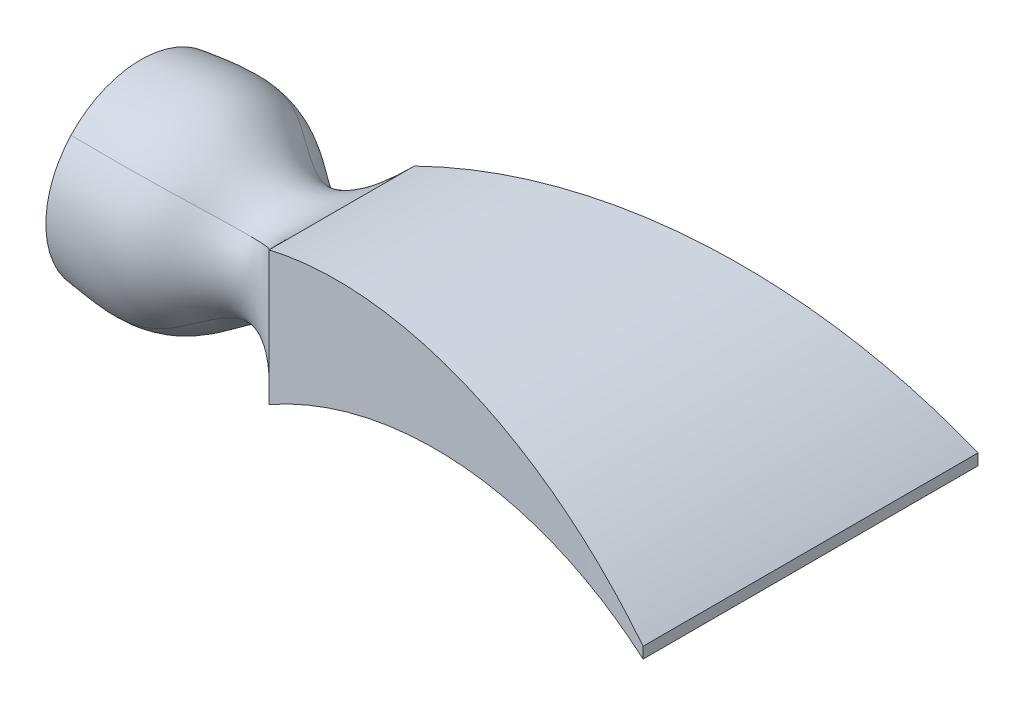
ISO-10303-21;
HEADER;
FILE_DESCRIPTION(('STEP AP214'),'2;1');
FILE_NAME('part.step','',(''),(''),'','','');
FILE_SCHEMA(('AUTOMOTIVE_DESIGN { 1 0 10303 214 1 1 1 1 }'));
ENDSEC;
DATA;
#1=APPLICATION_CONTEXT('core data for automotive mechanical design processes');
#2=APPLICATION_PROTOCOL_DEFINITION('international standard','automotive_design',2000,#1);
#3=PRODUCT_CONTEXT('',#1,'mechanical');
#4=PRODUCT('Part','Part','',(#3));
#5=PRODUCT_RELATED_PRODUCT_CATEGORY('part','',(#4));
#6=PRODUCT_DEFINITION_FORMATION('','',#4);
#7=PRODUCT_DEFINITION_CONTEXT('part definition',#1,'design');
#8=PRODUCT_DEFINITION('design','',#6,#7);
#9=PRODUCT_DEFINITION_SHAPE('','',#8);
#10=(LENGTH_UNIT() NAMED_UNIT(*) SI_UNIT(.MILLI.,.METRE.));
#11=(NAMED_UNIT(*) PLANE_ANGLE_UNIT() SI_UNIT($,.RADIAN.));
#12=(NAMED_UNIT(*) SI_UNIT($,.STERADIAN.) SOLID_ANGLE_UNIT());
#13=UNCERTAINTY_MEASURE_WITH_UNIT(LENGTH_MEASURE(1.E-05),#10,'distance_accuracy_value','');
#14=(GEOMETRIC_REPRESENTATION_CONTEXT(3) GLOBAL_UNCERTAINTY_ASSIGNED_CONTEXT((#13)) GLOBAL_UNIT_ASSIGNED_CONTEXT((#10,
#11,#12)) REPRESENTATION_CONTEXT('',''));
#15=CARTESIAN_POINT('',(0.,0.,0.));
#16=DIRECTION('',(0.,0.,1.));
#17=DIRECTION('',(1.,0.,0.));
#18=AXIS2_PLACEMENT_3D('',#15,#16,#17);
#19=CARTESIAN_POINT('',(0.,0.,0.));
#20=DIRECTION('',(1.,0.,0.));
#21=DIRECTION('',(0.,0.,-1.));
#22=AXIS2_PLACEMENT_3D('',#19,#20,#21);
#23=PLANE('',#22);
#24=CARTESIAN_POINT('',(0.,0.,0.));
#25=DIRECTION('',(1.,0.,0.));
#26=DIRECTION('',(0.,0.,-1.));
#27=AXIS2_PLACEMENT_3D('',#24,#25,#26);
#28=CIRCLE('',#27,42.5);
#29=CARTESIAN_POINT('',(0.,-28.8269043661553,-31.2291463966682));
#30=VERTEX_POINT('',#29);
#31=CARTESIAN_POINT('',(0.,28.8269043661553,-31.2291463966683));
#32=VERTEX_POINT('',#31);
#33=EDGE_CURVE('E353',#30,#32,#28,.T.);
#34=ORIENTED_EDGE('',*,*,#33,.F.);
#35=CARTESIAN_POINT('',(0.,-28.8269043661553,31.2291463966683));
#36=VERTEX_POINT('',#35);
#37=EDGE_CURVE('E358',#36,#30,#28,.T.);
#38=ORIENTED_EDGE('',*,*,#37,.F.);
#39=CARTESIAN_POINT('',(0.,28.8269043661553,31.2291463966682));
#40=VERTEX_POINT('',#39);
#41=EDGE_CURVE('E365',#40,#36,#28,.T.);
#42=ORIENTED_EDGE('',*,*,#41,.F.);
#43=EDGE_CURVE('E361',#32,#40,#28,.T.);
#44=ORIENTED_EDGE('',*,*,#43,.F.);
#45=EDGE_LOOP('',(#34,#38,#42,#44));
#46=FACE_BOUND('',#45,.T.);
#47=ADVANCED_FACE('F204',(#46),#23,.F.);
#48=CARTESIAN_POINT('',(0.,28.8269043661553,31.2291463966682));
#49=CARTESIAN_POINT('',(14.0252873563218,30.0049287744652,32.5053395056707));
#50=CARTESIAN_POINT('',(38.049638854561,32.7541160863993,35.483625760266));
#51=CARTESIAN_POINT('',(64.2575115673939,11.0839417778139,12.0076035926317));
#52=CARTESIAN_POINT('',(82.1458189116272,21.8102928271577,23.6278172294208));
#53=CARTESIAN_POINT('',(90.,30.,32.5));
#54=CARTESIAN_POINT('',(0.,12.5555966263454,46.2488150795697));
#55=CARTESIAN_POINT('',(14.0252873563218,12.9482714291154,47.5250081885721));
#56=CARTESIAN_POINT('',(38.049638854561,13.8832946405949,50.5982429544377));
#57=CARTESIAN_POINT('',(64.2575115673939,5.86382028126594,23.064396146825));
#58=CARTESIAN_POINT('',(82.1458189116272,7.27009760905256,23.6278172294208));
#59=CARTESIAN_POINT('',(90.,10.,32.5));
#60=CARTESIAN_POINT('',(0.,-12.5555966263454,46.2488150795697));
#61=CARTESIAN_POINT('',(14.0252873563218,-12.9482714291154,47.5250081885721));
#62=CARTESIAN_POINT('',(38.049638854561,-13.8832946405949,50.5982429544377));
#63=CARTESIAN_POINT('',(64.2575115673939,-5.86382028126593,23.064396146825));
#64=CARTESIAN_POINT('',(82.1458189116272,-7.27009760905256,23.6278172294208));
#65=CARTESIAN_POINT('',(90.,-10.,32.5));
#66=CARTESIAN_POINT('',(0.,-28.8269043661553,31.2291463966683));
#67=CARTESIAN_POINT('',(14.0252873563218,-30.0049287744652,32.5053395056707));
#68=CARTESIAN_POINT('',(38.049638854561,-32.7541160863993,35.4836257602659));
#69=CARTESIAN_POINT('',(64.2575115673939,-11.0839417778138,12.0076035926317));
#70=CARTESIAN_POINT('',(82.1458189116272,-21.8102928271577,23.6278172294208));
#71=CARTESIAN_POINT('',(90.,-30.,32.5));
#72=B_SPLINE_SURFACE_WITH_KNOTS('',3,3,((#48,#49,#50,#51,#52,#53),(#54,#55,#56,#57,#58,#59),
(#60,#61,#62,#63,#64,#65),(#66,#67,#68,#69,#70,#71)),.UNSPECIFIED.,.F.,.F.,.F.,(4,4),(4,1,1,4),
(0.,1.),(0.,0.409369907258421,0.7071658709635,1.),.UNSPECIFIED.);
#73=CARTESIAN_POINT('',(0.,-28.8269043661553,31.2291463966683));
#74=CARTESIAN_POINT('',(14.0252873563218,-30.0049287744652,32.5053395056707));
#75=CARTESIAN_POINT('',(38.049638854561,-32.7541160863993,35.4836257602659));
#76=CARTESIAN_POINT('',(64.2575115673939,-11.0839417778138,12.0076035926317));
#77=CARTESIAN_POINT('',(82.1458189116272,-21.8102928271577,23.6278172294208));
#78=CARTESIAN_POINT('',(90.,-30.,32.5));
#79=B_SPLINE_CURVE_WITH_KNOTS('',3,(#73,#74,#75,#76,#77,#78),.UNSPECIFIED.,.F.,.F.,(4,1,1,4),
(0.,0.409369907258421,0.7071658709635,1.),.UNSPECIFIED.);
#80=CARTESIAN_POINT('',(90.,-30.,32.5));
#81=VERTEX_POINT('',#80);
#82=EDGE_CURVE('E233',#36,#81,#79,.T.);
#83=DIRECTION('',(0.,-1.,0.));
#84=VECTOR('',#83,1.);
#85=CARTESIAN_POINT('',(90.,-30.,32.5));
#86=LINE('',#85,#84);
#87=CARTESIAN_POINT('',(90.,30.,32.5));
#88=VERTEX_POINT('',#87);
#89=EDGE_CURVE('E217',#88,#81,#86,.T.);
#90=CARTESIAN_POINT('',(0.,28.8269043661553,31.2291463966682));
#91=CARTESIAN_POINT('',(14.0252873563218,30.0049287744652,32.5053395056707));
#92=CARTESIAN_POINT('',(38.049638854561,32.7541160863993,35.483625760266));
#93=CARTESIAN_POINT('',(64.2575115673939,11.0839417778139,12.0076035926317));
#94=CARTESIAN_POINT('',(82.1458189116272,21.8102928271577,23.6278172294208));
#95=CARTESIAN_POINT('',(90.,30.,32.5));
#96=B_SPLINE_CURVE_WITH_KNOTS('',3,(#90,#91,#92,#93,#94,#95),.UNSPECIFIED.,.F.,.F.,(4,1,1,4),
(0.,0.409369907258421,0.7071658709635,1.),.UNSPECIFIED.);
#97=EDGE_CURVE('E446',#88,#40,#96,.F.);
#98=ORIENTED_EDGE('',*,*,#41,.T.);
#99=ORIENTED_EDGE('',*,*,#82,.T.);
#100=ORIENTED_EDGE('',*,*,#89,.F.);
#101=ORIENTED_EDGE('',*,*,#97,.T.);
#102=EDGE_LOOP('',(#98,#99,#100,#101));
#103=FACE_BOUND('',#102,.T.);
#104=ADVANCED_FACE('F386',(#103),#72,.T.);
#105=CARTESIAN_POINT('',(0.,-28.8269043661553,31.2291463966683));
#106=CARTESIAN_POINT('',(14.0252873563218,-30.0049287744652,32.5053395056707));
#107=CARTESIAN_POINT('',(38.049638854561,-32.7541160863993,35.483625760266));
#108=CARTESIAN_POINT('',(64.2575115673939,-11.0839417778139,12.0076035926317));
#109=CARTESIAN_POINT('',(82.1458189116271,-21.8102928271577,23.6278172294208));
#110=CARTESIAN_POINT('',(90.,-30.,32.5));
#111=CARTESIAN_POINT('',(0.,-31.0057855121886,29.2178714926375));
#112=CARTESIAN_POINT('',(14.0252560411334,-32.2675112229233,30.4072340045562));
#113=CARTESIAN_POINT('',(38.0079865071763,-35.0074364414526,33.134204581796));
#114=CARTESIAN_POINT('',(64.3604771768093,-12.475367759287,11.3962638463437));
#115=CARTESIAN_POINT('',(81.9263489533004,-22.2778386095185,21.7600120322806));
#116=CARTESIAN_POINT('',(90.,-30.,29.7916666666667));
#117=CARTESIAN_POINT('',(0.,-33.9206748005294,25.8954245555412));
#118=CARTESIAN_POINT('',(14.0252090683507,-35.3079524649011,26.9545411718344));
#119=CARTESIAN_POINT('',(37.9455079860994,-38.0312564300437,29.3019499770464));
#120=CARTESIAN_POINT('',(64.5149255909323,-14.3035464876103,10.2559568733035));
#121=CARTESIAN_POINT('',(81.5971440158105,-22.9791572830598,18.9583042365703));
#122=CARTESIAN_POINT('',(90.,-30.,25.7291666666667));
#123=CARTESIAN_POINT('',(0.,-37.0494048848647,20.9740485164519));
#124=CARTESIAN_POINT('',(14.025322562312,-38.5632606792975,21.8310323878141));
#125=CARTESIAN_POINT('',(37.8988243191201,-41.2834499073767,23.6831781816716));
#126=CARTESIAN_POINT('',(64.6302175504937,-16.255801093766,8.43102119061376));
#127=CARTESIAN_POINT('',(81.3514262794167,-23.7455118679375,15.0861877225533));
#128=CARTESIAN_POINT('',(90.0000000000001,-30.,20.3125));
#129=CARTESIAN_POINT('',(0.,-38.9996836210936,17.0769647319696));
#130=CARTESIAN_POINT('',(14.0253779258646,-40.5934404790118,17.7754496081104));
#131=CARTESIAN_POINT('',(37.872711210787,-43.3120934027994,19.2572261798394));
#132=CARTESIAN_POINT('',(64.6947136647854,-17.4685107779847,6.92696460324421));
#133=CARTESIAN_POINT('',(81.2139665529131,-24.2360568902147,12.1394883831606));
#134=CARTESIAN_POINT('',(90.0000000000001,-30.,16.25));
#135=CARTESIAN_POINT('',(0.,-40.5422247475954,12.9939174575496));
#136=CARTESIAN_POINT('',(14.0251611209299,-42.1990179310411,13.5241865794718));
#137=CARTESIAN_POINT('',(37.8553861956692,-44.9176257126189,14.6330297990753));
#138=CARTESIAN_POINT('',(64.7376940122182,-18.4253077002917,5.32072772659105));
#139=CARTESIAN_POINT('',(81.1223192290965,-24.6275231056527,9.15397849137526));
#140=CARTESIAN_POINT('',(90.0000000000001,-30.,12.1875));
#141=CARTESIAN_POINT('',(0.,-42.0351974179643,7.37053527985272));
#142=CARTESIAN_POINT('',(14.0253533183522,-43.7529740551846,7.67182588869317));
#143=CARTESIAN_POINT('',(37.8405440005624,-46.4719777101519,8.28857635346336));
#144=CARTESIAN_POINT('',(64.7742321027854,-19.3503599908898,3.04664159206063));
#145=CARTESIAN_POINT('',(81.0444738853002,-25.0090345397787,5.12143933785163));
#146=CARTESIAN_POINT('',(90.,-30.,6.77083333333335));
#147=CARTESIAN_POINT('',(0.,-42.8106082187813,-0.000175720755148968));
#148=CARTESIAN_POINT('',(14.0253047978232,-44.5601581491,-0.00020295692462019));
#149=CARTESIAN_POINT('',(37.8345893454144,-47.2796606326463,-0.000240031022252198));
#150=CARTESIAN_POINT('',(64.7889851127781,-19.8297609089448,4.72186189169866E-05));
#151=CARTESIAN_POINT('',(81.0130204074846,-25.2075581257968,2.55297718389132E-05));
#152=CARTESIAN_POINT('',(89.9999999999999,-30.,0.));
#153=CARTESIAN_POINT('',(0.,-42.0352320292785,-7.37019257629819));
#154=CARTESIAN_POINT('',(14.0253511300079,-43.7530146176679,-7.67143011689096));
#155=CARTESIAN_POINT('',(37.8405452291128,-46.4720247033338,-8.28810822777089));
#156=CARTESIAN_POINT('',(64.7742307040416,-19.3503509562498,-3.04673364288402));
#157=CARTESIAN_POINT('',(81.0444764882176,-25.0090290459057,-5.12148921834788));
#158=CARTESIAN_POINT('',(90.,-30.,-6.77083333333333));
#159=CARTESIAN_POINT('',(0.,-40.5422308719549,-12.9939763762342));
#160=CARTESIAN_POINT('',(14.0251623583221,-42.1990246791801,-13.5242545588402));
#161=CARTESIAN_POINT('',(37.855385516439,-44.9176342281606,-14.633110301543));
#162=CARTESIAN_POINT('',(64.7376947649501,-18.42530592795,-5.32071189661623));
#163=CARTESIAN_POINT('',(81.1223178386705,-24.6275224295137,-9.15396991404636));
#164=CARTESIAN_POINT('',(90.,-30.,-12.1875));
#165=CARTESIAN_POINT('',(0.,-38.9996771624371,-17.0769448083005));
#166=CARTESIAN_POINT('',(14.0253771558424,-40.5934332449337,-17.7754266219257));
#167=CARTESIAN_POINT('',(37.8727116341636,-43.3120844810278,-19.2571989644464));
#168=CARTESIAN_POINT('',(64.6947131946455,-17.4685125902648,-6.92696993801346));
#169=CARTESIAN_POINT('',(81.213967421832,-24.2360577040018,-12.1394913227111));
#170=CARTESIAN_POINT('',(90.0000000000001,-30.,-16.25));
#171=CARTESIAN_POINT('',(0.,-37.0494129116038,-20.9740493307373));
#172=CARTESIAN_POINT('',(14.0253228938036,-38.5632697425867,-21.8310334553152));
#173=CARTESIAN_POINT('',(37.8988241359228,-41.283460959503,-23.683179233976));
#174=CARTESIAN_POINT('',(64.6302177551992,-16.2557988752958,-8.43102102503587));
#175=CARTESIAN_POINT('',(81.3514259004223,-23.7455107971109,-15.0861875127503));
#176=CARTESIAN_POINT('',(90.0000000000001,-30.,-20.3125));
#177=CARTESIAN_POINT('',(0.,-33.9206215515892,-25.8954921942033));
#178=CARTESIAN_POINT('',(14.0252088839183,-35.3078916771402,-26.9546184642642));
#179=CARTESIAN_POINT('',(37.945508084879,-38.0311834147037,-29.3020426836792));
#180=CARTESIAN_POINT('',(64.5149254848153,-14.3035609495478,-10.2559385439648));
#181=CARTESIAN_POINT('',(81.5971442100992,-22.9791648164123,-18.9582945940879));
#182=CARTESIAN_POINT('',(90.,-30.,-25.7291666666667));
#183=CARTESIAN_POINT('',(0.,-31.0057855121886,-29.2178714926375));
#184=CARTESIAN_POINT('',(14.0252559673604,-32.267508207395,-30.4072378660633));
#185=CARTESIAN_POINT('',(38.0079865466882,-35.0074380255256,-33.134202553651));
#186=CARTESIAN_POINT('',(64.3604771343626,-12.4753661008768,-11.3962659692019));
#187=CARTESIAN_POINT('',(81.9263490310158,-22.2778416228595,-21.7600081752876));
#188=CARTESIAN_POINT('',(90.,-30.,-29.7916666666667));
#189=CARTESIAN_POINT('',(0.,-28.8269043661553,-31.2291463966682));
#190=CARTESIAN_POINT('',(14.0252873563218,-30.0049287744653,-32.5053395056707));
#191=CARTESIAN_POINT('',(38.049638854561,-32.7541160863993,-35.4836257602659));
#192=CARTESIAN_POINT('',(64.2575115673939,-11.0839417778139,-12.0076035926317));
#193=CARTESIAN_POINT('',(82.1458189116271,-21.8102928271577,-23.6278172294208));
#194=CARTESIAN_POINT('',(90.,-30.,-32.5));
#195=B_SPLINE_SURFACE_WITH_KNOTS('',3,3,((#105,#106,#107,#108,#109,#110),(#111,#112,#113,#114,
#115,#116),(#117,#118,#119,#120,#121,#122),(#123,#124,#125,#126,#127,#128),(#129,#130,#131,#132,
#133,#134),(#135,#136,#137,#138,#139,#140),(#141,#142,#143,#144,#145,#146),(#147,#148,#149,#150,
#151,#152),(#153,#154,#155,#156,#157,#158),(#159,#160,#161,#162,#163,#164),(#165,#166,#167,#168,
#169,#170),(#171,#172,#173,#174,#175,#176),(#177,#178,#179,#180,#181,#182),(#183,#184,#185,#186,
#187,#188),(#189,#190,#191,#192,#193,#194)),.UNSPECIFIED.,.F.,.F.,.F.,(4,1,1,1,1,1,1,1,1,1,1,1,
4),(4,1,1,4),(0.,0.125,0.1875,0.25,0.3125,0.375,0.5,0.625,0.6875,0.75,0.8125,0.875,1.),(0.,
0.409369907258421,0.7071658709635,1.),.UNSPECIFIED.);
#196=CARTESIAN_POINT('',(0.,-28.8269043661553,-31.2291463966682));
#197=CARTESIAN_POINT('',(14.0252873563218,-30.0049287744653,-32.5053395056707));
#198=CARTESIAN_POINT('',(38.049638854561,-32.7541160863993,-35.4836257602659));
#199=CARTESIAN_POINT('',(64.2575115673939,-11.0839417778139,-12.0076035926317));
#200=CARTESIAN_POINT('',(82.1458189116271,-21.8102928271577,-23.6278172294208));
#201=CARTESIAN_POINT('',(90.,-30.,-32.5));
#202=B_SPLINE_CURVE_WITH_KNOTS('',3,(#196,#197,#198,#199,#200,#201),.UNSPECIFIED.,.F.,.F.,(4,1,
1,4),(0.,0.409369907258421,0.7071658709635,1.),.UNSPECIFIED.);
#203=CARTESIAN_POINT('',(90.,-30.,-32.5));
#204=VERTEX_POINT('',#203);
#205=EDGE_CURVE('E427',#30,#204,#202,.T.);
#206=DIRECTION('',(0.,0.,-1.));
#207=VECTOR('',#206,1.);
#208=CARTESIAN_POINT('',(90.,-30.,32.5));
#209=LINE('',#208,#207);
#210=EDGE_CURVE('E13',#81,#204,#209,.T.);
#211=ORIENTED_EDGE('',*,*,#37,.T.);
#212=ORIENTED_EDGE('',*,*,#205,.T.);
#213=ORIENTED_EDGE('',*,*,#210,.F.);
#214=ORIENTED_EDGE('',*,*,#82,.F.);
#215=EDGE_LOOP('',(#211,#212,#213,#214));
#216=FACE_BOUND('',#215,.T.);
#217=ADVANCED_FACE('F481',(#216),#195,.T.);
#218=CARTESIAN_POINT('',(0.,28.8269043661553,-31.2291463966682));
#219=CARTESIAN_POINT('',(14.0252873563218,30.0049287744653,-32.5053395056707));
#220=CARTESIAN_POINT('',(38.049638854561,32.7541160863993,-35.483625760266));
#221=CARTESIAN_POINT('',(64.2575115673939,11.0839417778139,-12.0076035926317));
#222=CARTESIAN_POINT('',(82.1458189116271,21.8102928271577,-23.6278172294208));
#223=CARTESIAN_POINT('',(90.,30.,-32.5));
#224=CARTESIAN_POINT('',(0.,31.0057855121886,-29.2178714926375));
#225=CARTESIAN_POINT('',(14.0252560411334,32.2675112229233,-30.4072340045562));
#226=CARTESIAN_POINT('',(38.0079865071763,35.0074364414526,-33.134204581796));
#227=CARTESIAN_POINT('',(64.3604771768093,12.475367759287,-11.3962638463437));
#228=CARTESIAN_POINT('',(81.9263489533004,22.2778386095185,-21.7600120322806));
#229=CARTESIAN_POINT('',(90.,30.,-29.7916666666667));
#230=CARTESIAN_POINT('',(0.,33.9206748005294,-25.8954245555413));
#231=CARTESIAN_POINT('',(14.0252090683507,35.307952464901,-26.9545411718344));
#232=CARTESIAN_POINT('',(37.9455079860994,38.0312564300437,-29.3019499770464));
#233=CARTESIAN_POINT('',(64.5149255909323,14.3035464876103,-10.2559568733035));
#234=CARTESIAN_POINT('',(81.5971440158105,22.9791572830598,-18.9583042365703));
#235=CARTESIAN_POINT('',(90.,30.,-25.7291666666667));
#236=CARTESIAN_POINT('',(0.,37.0494048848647,-20.9740485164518));
#237=CARTESIAN_POINT('',(14.025322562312,38.5632606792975,-21.831032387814));
#238=CARTESIAN_POINT('',(37.8988243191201,41.2834499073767,-23.6831781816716));
#239=CARTESIAN_POINT('',(64.6302175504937,16.255801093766,-8.43102119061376));
#240=CARTESIAN_POINT('',(81.3514262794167,23.7455118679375,-15.0861877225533));
#241=CARTESIAN_POINT('',(90.0000000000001,30.,-20.3125));
#242=CARTESIAN_POINT('',(0.,38.9996836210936,-17.0769647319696));
#243=CARTESIAN_POINT('',(14.0253779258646,40.5934404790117,-17.7754496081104));
#244=CARTESIAN_POINT('',(37.872711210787,43.3120934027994,-19.2572261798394));
#245=CARTESIAN_POINT('',(64.6947136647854,17.4685107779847,-6.9269646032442));
#246=CARTESIAN_POINT('',(81.2139665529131,24.2360568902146,-12.1394883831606));
#247=CARTESIAN_POINT('',(90.0000000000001,30.,-16.25));
#248=CARTESIAN_POINT('',(0.,40.5422247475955,-12.9939174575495));
#249=CARTESIAN_POINT('',(14.0251611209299,42.1990179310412,-13.5241865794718));
#250=CARTESIAN_POINT('',(37.8553861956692,44.9176257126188,-14.6330297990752));
#251=CARTESIAN_POINT('',(64.7376940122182,18.4253077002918,-5.32072772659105));
#252=CARTESIAN_POINT('',(81.1223192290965,24.6275231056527,-9.15397849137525));
#253=CARTESIAN_POINT('',(90.0000000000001,30.,-12.1875));
#254=CARTESIAN_POINT('',(0.,42.0351974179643,-7.37053527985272));
#255=CARTESIAN_POINT('',(14.0253533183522,43.7529740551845,-7.67182588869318));
#256=CARTESIAN_POINT('',(37.8405440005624,46.471977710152,-8.28857635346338));
#257=CARTESIAN_POINT('',(64.7742321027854,19.3503599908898,-3.04664159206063));
#258=CARTESIAN_POINT('',(81.0444738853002,25.0090345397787,-5.12143933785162));
#259=CARTESIAN_POINT('',(90.,30.,-6.77083333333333));
#260=CARTESIAN_POINT('',(0.,42.8106082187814,0.000175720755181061));
#261=CARTESIAN_POINT('',(14.0253047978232,44.5601581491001,0.000202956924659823));
#262=CARTESIAN_POINT('',(37.8345893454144,47.2796606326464,0.000240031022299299));
#263=CARTESIAN_POINT('',(64.7889851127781,19.8297609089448,-4.72186189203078E-05));
#264=CARTESIAN_POINT('',(81.0130204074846,25.2075581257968,-2.55297718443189E-05));
#265=CARTESIAN_POINT('',(89.9999999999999,30.,0.));
#266=CARTESIAN_POINT('',(0.,42.0352320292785,7.37019257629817));
#267=CARTESIAN_POINT('',(14.0253511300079,43.753014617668,7.67143011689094));
#268=CARTESIAN_POINT('',(37.8405452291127,46.4720247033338,8.28810822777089));
#269=CARTESIAN_POINT('',(64.7742307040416,19.3503509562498,3.04673364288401));
#270=CARTESIAN_POINT('',(81.0444764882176,25.0090290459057,5.12148921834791));
#271=CARTESIAN_POINT('',(90.,30.,6.77083333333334));
#272=CARTESIAN_POINT('',(0.,40.542230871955,12.9939763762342));
#273=CARTESIAN_POINT('',(14.0251623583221,42.19902467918,13.5242545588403));
#274=CARTESIAN_POINT('',(37.855385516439,44.9176342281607,14.633110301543));
#275=CARTESIAN_POINT('',(64.7376947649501,18.42530592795,5.32071189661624));
#276=CARTESIAN_POINT('',(81.1223178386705,24.6275224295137,9.15396991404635));
#277=CARTESIAN_POINT('',(90.,30.,12.1875));
#278=CARTESIAN_POINT('',(0.,38.999677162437,17.0769448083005));
#279=CARTESIAN_POINT('',(14.0253771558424,40.5934332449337,17.7754266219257));
#280=CARTESIAN_POINT('',(37.8727116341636,43.3120844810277,19.2571989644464));
#281=CARTESIAN_POINT('',(64.6947131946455,17.4685125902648,6.92696993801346));
#282=CARTESIAN_POINT('',(81.213967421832,24.2360577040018,12.1394913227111));
#283=CARTESIAN_POINT('',(90.0000000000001,30.,16.25));
#284=CARTESIAN_POINT('',(0.,37.0494129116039,20.9740493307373));
#285=CARTESIAN_POINT('',(14.0253228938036,38.5632697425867,21.8310334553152));
#286=CARTESIAN_POINT('',(37.8988241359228,41.2834609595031,23.6831792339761));
#287=CARTESIAN_POINT('',(64.6302177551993,16.2557988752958,8.43102102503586));
#288=CARTESIAN_POINT('',(81.3514259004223,23.7455107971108,15.0861875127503));
#289=CARTESIAN_POINT('',(90.0000000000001,30.,20.3125));
#290=CARTESIAN_POINT('',(0.,33.9206215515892,25.8954921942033));
#291=CARTESIAN_POINT('',(14.0252088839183,35.3078916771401,26.9546184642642));
#292=CARTESIAN_POINT('',(37.9455080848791,38.0311834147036,29.3020426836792));
#293=CARTESIAN_POINT('',(64.5149254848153,14.3035609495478,10.2559385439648));
#294=CARTESIAN_POINT('',(81.5971442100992,22.9791648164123,18.9582945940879));
#295=CARTESIAN_POINT('',(90.,30.,25.7291666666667));
#296=CARTESIAN_POINT('',(0.,31.0057855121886,29.2178714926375));
#297=CARTESIAN_POINT('',(14.0252559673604,32.267508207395,30.4072378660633));
#298=CARTESIAN_POINT('',(38.0079865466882,35.0074380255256,33.1342025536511));
#299=CARTESIAN_POINT('',(64.3604771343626,12.4753661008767,11.3962659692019));
#300=CARTESIAN_POINT('',(81.9263490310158,22.2778416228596,21.7600081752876));
#301=CARTESIAN_POINT('',(90.,30.,29.7916666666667));
#302=CARTESIAN_POINT('',(0.,28.8269043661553,31.2291463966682));
#303=CARTESIAN_POINT('',(14.0252873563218,30.0049287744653,32.5053395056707));
#304=CARTESIAN_POINT('',(38.049638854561,32.7541160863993,35.483625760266));
#305=CARTESIAN_POINT('',(64.2575115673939,11.0839417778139,12.0076035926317));
#306=CARTESIAN_POINT('',(82.1458189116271,21.8102928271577,23.6278172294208));
#307=CARTESIAN_POINT('',(90.,30.,32.5));
#308=B_SPLINE_SURFACE_WITH_KNOTS('',3,3,((#218,#219,#220,#221,#222,#223),(#224,#225,#226,#227,
#228,#229),(#230,#231,#232,#233,#234,#235),(#236,#237,#238,#239,#240,#241),(#242,#243,#244,#245,
#246,#247),(#248,#249,#250,#251,#252,#253),(#254,#255,#256,#257,#258,#259),(#260,#261,#262,#263,
#264,#265),(#266,#267,#268,#269,#270,#271),(#272,#273,#274,#275,#276,#277),(#278,#279,#280,#281,
#282,#283),(#284,#285,#286,#287,#288,#289),(#290,#291,#292,#293,#294,#295),(#296,#297,#298,#299,
#300,#301),(#302,#303,#304,#305,#306,#307)),.UNSPECIFIED.,.F.,.F.,.F.,(4,1,1,1,1,1,1,1,1,1,1,1,
4),(4,1,1,4),(0.,0.125,0.1875,0.25,0.3125,0.375,0.5,0.625,0.6875,0.75,0.8125,0.875,1.),(0.,
0.409369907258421,0.7071658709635,1.),.UNSPECIFIED.);
#309=DIRECTION('',(0.,0.,1.));
#310=VECTOR('',#309,1.);
#311=CARTESIAN_POINT('',(90.,30.,32.5));
#312=LINE('',#311,#310);
#313=CARTESIAN_POINT('',(90.,30.,-32.5));
#314=VERTEX_POINT('',#313);
#315=EDGE_CURVE('E405',#314,#88,#312,.T.);
#316=CARTESIAN_POINT('',(0.,28.8269043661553,-31.2291463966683));
#317=CARTESIAN_POINT('',(14.0252873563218,30.0049287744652,-32.5053395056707));
#318=CARTESIAN_POINT('',(38.049638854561,32.7541160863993,-35.483625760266));
#319=CARTESIAN_POINT('',(64.2575115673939,11.0839417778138,-12.0076035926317));
#320=CARTESIAN_POINT('',(82.1458189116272,21.8102928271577,-23.6278172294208));
#321=CARTESIAN_POINT('',(90.,30.,-32.5));
#322=B_SPLINE_CURVE_WITH_KNOTS('',3,(#316,#317,#318,#319,#320,#321),.UNSPECIFIED.,.F.,.F.,(4,1,
1,4),(0.,0.409369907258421,0.7071658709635,1.),.UNSPECIFIED.);
#323=EDGE_CURVE('E422',#32,#314,#322,.T.);
#324=ORIENTED_EDGE('',*,*,#43,.T.);
#325=ORIENTED_EDGE('',*,*,#97,.F.);
#326=ORIENTED_EDGE('',*,*,#315,.F.);
#327=ORIENTED_EDGE('',*,*,#323,.F.);
#328=EDGE_LOOP('',(#324,#325,#326,#327));
#329=FACE_BOUND('',#328,.T.);
#330=ADVANCED_FACE('F471',(#329),#308,.T.);
#331=CARTESIAN_POINT('',(0.,-28.8269043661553,-31.2291463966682));
#332=CARTESIAN_POINT('',(14.0252873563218,-30.0049287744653,-32.5053395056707));
#333=CARTESIAN_POINT('',(38.049638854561,-32.7541160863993,-35.483625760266));
#334=CARTESIAN_POINT('',(64.2575115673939,-11.0839417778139,-12.0076035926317));
#335=CARTESIAN_POINT('',(82.1458189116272,-21.8102928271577,-23.6278172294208));
#336=CARTESIAN_POINT('',(90.,-30.,-32.5));
#337=CARTESIAN_POINT('',(0.,-12.5555966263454,-46.2488150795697));
#338=CARTESIAN_POINT('',(14.0252873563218,-12.9482714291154,-47.5250081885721));
#339=CARTESIAN_POINT('',(38.049638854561,-13.8832946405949,-50.5982429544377));
#340=CARTESIAN_POINT('',(64.2575115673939,-5.86382028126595,-23.064396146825));
#341=CARTESIAN_POINT('',(82.1458189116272,-7.27009760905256,-23.6278172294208));
#342=CARTESIAN_POINT('',(90.,-10.,-32.5));
#343=CARTESIAN_POINT('',(0.,12.5555966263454,-46.2488150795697));
#344=CARTESIAN_POINT('',(14.0252873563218,12.9482714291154,-47.5250081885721));
#345=CARTESIAN_POINT('',(38.049638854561,13.8832946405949,-50.5982429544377));
#346=CARTESIAN_POINT('',(64.2575115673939,5.86382028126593,-23.064396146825));
#347=CARTESIAN_POINT('',(82.1458189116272,7.27009760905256,-23.6278172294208));
#348=CARTESIAN_POINT('',(90.,10.,-32.5));
#349=CARTESIAN_POINT('',(0.,28.8269043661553,-31.2291463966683));
#350=CARTESIAN_POINT('',(14.0252873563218,30.0049287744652,-32.5053395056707));
#351=CARTESIAN_POINT('',(38.049638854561,32.7541160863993,-35.483625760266));
#352=CARTESIAN_POINT('',(64.2575115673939,11.0839417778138,-12.0076035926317));
#353=CARTESIAN_POINT('',(82.1458189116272,21.8102928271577,-23.6278172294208));
#354=CARTESIAN_POINT('',(90.,30.,-32.5));
#355=B_SPLINE_SURFACE_WITH_KNOTS('',3,3,((#331,#332,#333,#334,#335,#336),(#337,#338,#339,#340,
#341,#342),(#343,#344,#345,#346,#347,#348),(#349,#350,#351,#352,#353,#354)),.UNSPECIFIED.,.F.,
.F.,.F.,(4,4),(4,1,1,4),(0.,1.),(0.,0.409369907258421,0.7071658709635,1.),.UNSPECIFIED.);
#356=DIRECTION('',(0.,1.,0.));
#357=VECTOR('',#356,1.);
#358=CARTESIAN_POINT('',(90.,-30.,-32.5));
#359=LINE('',#358,#357);
#360=EDGE_CURVE('E225',#204,#314,#359,.T.);
#361=ORIENTED_EDGE('',*,*,#33,.T.);
#362=ORIENTED_EDGE('',*,*,#323,.T.);
#363=ORIENTED_EDGE('',*,*,#360,.F.);
#364=ORIENTED_EDGE('',*,*,#205,.F.);
#365=EDGE_LOOP('',(#361,#362,#363,#364));
#366=FACE_BOUND('',#365,.T.);
#367=ADVANCED_FACE('F206',(#366),#355,.T.);
#368=CARTESIAN_POINT('',(300.,0.,0.));
#369=DIRECTION('',(-1.,0.,0.));
#370=DIRECTION('',(0.,0.,1.));
#371=AXIS2_PLACEMENT_3D('',#368,#369,#370);
#372=PLANE('',#371);
#373=DIRECTION('',(0.,1.,0.));
#374=VECTOR('',#373,1.);
#375=CARTESIAN_POINT('',(300.,-2.5,-75.));
#376=LINE('',#375,#374);
#377=CARTESIAN_POINT('',(300.,-2.5,-75.));
#378=VERTEX_POINT('',#377);
#379=CARTESIAN_POINT('',(300.,2.5,-75.));
#380=VERTEX_POINT('',#379);
#381=EDGE_CURVE('E336',#378,#380,#376,.T.);
#382=ORIENTED_EDGE('',*,*,#381,.T.);
#383=DIRECTION('',(0.,0.,1.));
#384=VECTOR('',#383,1.);
#385=CARTESIAN_POINT('',(300.,2.5,75.));
#386=LINE('',#385,#384);
#387=CARTESIAN_POINT('',(300.,2.5,75.));
#388=VERTEX_POINT('',#387);
#389=EDGE_CURVE('E292',#380,#388,#386,.T.);
#390=ORIENTED_EDGE('',*,*,#389,.T.);
#391=DIRECTION('',(0.,-1.,0.));
#392=VECTOR('',#391,1.);
#393=CARTESIAN_POINT('',(300.,-2.5,75.));
#394=LINE('',#393,#392);
#395=CARTESIAN_POINT('',(300.,-2.5,75.));
#396=VERTEX_POINT('',#395);
#397=EDGE_CURVE('E269',#388,#396,#394,.T.);
#398=ORIENTED_EDGE('',*,*,#397,.T.);
#399=DIRECTION('',(0.,0.,-1.));
#400=VECTOR('',#399,1.);
#401=CARTESIAN_POINT('',(300.,-2.5,75.));
#402=LINE('',#401,#400);
#403=EDGE_CURVE('E275',#396,#378,#402,.T.);
#404=ORIENTED_EDGE('',*,*,#403,.T.);
#405=EDGE_LOOP('',(#382,#390,#398,#404));
#406=FACE_BOUND('',#405,.T.);
#407=ADVANCED_FACE('F291',(#406),#372,.F.);
#408=CARTESIAN_POINT('',(90.,30.,-32.5));
#409=CARTESIAN_POINT('',(160.089094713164,57.3447577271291,-46.6666666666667));
#410=CARTESIAN_POINT('',(239.315206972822,46.9699096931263,-60.8333333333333));
#411=CARTESIAN_POINT('',(300.,2.5,-75.));
#412=CARTESIAN_POINT('',(90.,30.,-27.9351780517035));
#413=CARTESIAN_POINT('',(160.089094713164,57.3447577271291,-42.3074673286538));
#414=CARTESIAN_POINT('',(239.315206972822,46.9699096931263,-56.6797566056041));
#415=CARTESIAN_POINT('',(300.,2.5,-71.0520458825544));
#416=CARTESIAN_POINT('',(90.,30.,-22.350652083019));
#417=CARTESIAN_POINT('',(160.089094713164,57.3447577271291,-35.6376420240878));
#418=CARTESIAN_POINT('',(239.315206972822,46.9699096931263,-48.9246319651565));
#419=CARTESIAN_POINT('',(300.,2.5,-62.2116219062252));
#420=CARTESIAN_POINT('',(90.0000000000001,30.,-14.6017532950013));
#421=CARTESIAN_POINT('',(160.089094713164,57.3447577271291,-24.6636818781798));
#422=CARTESIAN_POINT('',(239.315206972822,46.9699096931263,-34.7256104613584));
#423=CARTESIAN_POINT('',(300.,2.5,-44.787539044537));
#424=CARTESIAN_POINT('',(90.,30.,-7.67503183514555));
#425=CARTESIAN_POINT('',(160.089094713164,57.3447577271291,-12.1148643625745));
#426=CARTESIAN_POINT('',(239.315206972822,46.9699096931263,-16.5546968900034));
#427=CARTESIAN_POINT('',(300.,2.5,-20.9945294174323));
#428=CARTESIAN_POINT('',(90.,30.,-2.70833333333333));
#429=CARTESIAN_POINT('',(160.089094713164,57.3447577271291,-3.88888888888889));
#430=CARTESIAN_POINT('',(239.315206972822,46.9699096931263,-5.06944444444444));
#431=CARTESIAN_POINT('',(300.,2.5,-6.25));
#432=CARTESIAN_POINT('',(90.,30.,2.70833333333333));
#433=CARTESIAN_POINT('',(160.089094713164,57.3447577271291,3.88888888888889));
#434=CARTESIAN_POINT('',(239.315206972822,46.9699096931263,5.06944444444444));
#435=CARTESIAN_POINT('',(300.,2.5,6.25));
#436=CARTESIAN_POINT('',(90.,30.,7.67503183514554));
#437=CARTESIAN_POINT('',(160.089094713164,57.3447577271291,12.1148643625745));
#438=CARTESIAN_POINT('',(239.315206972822,46.9699096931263,16.5546968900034));
#439=CARTESIAN_POINT('',(300.,2.5,20.9945294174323));
#440=CARTESIAN_POINT('',(90.0000000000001,30.,14.6017532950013));
#441=CARTESIAN_POINT('',(160.089094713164,57.3447577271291,24.6636818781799));
#442=CARTESIAN_POINT('',(239.315206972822,46.9699096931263,34.7256104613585));
#443=CARTESIAN_POINT('',(300.,2.5,44.787539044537));
#444=CARTESIAN_POINT('',(89.9999999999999,30.,22.3506520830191));
#445=CARTESIAN_POINT('',(160.089094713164,57.3447577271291,35.6376420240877));
#446=CARTESIAN_POINT('',(239.315206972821,46.9699096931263,48.9246319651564));
#447=CARTESIAN_POINT('',(300.,2.5,62.2116219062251));
#448=CARTESIAN_POINT('',(90.,30.,27.9351780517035));
#449=CARTESIAN_POINT('',(160.089094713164,57.3447577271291,42.3074673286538));
#450=CARTESIAN_POINT('',(239.315206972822,46.9699096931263,56.679756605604));
#451=CARTESIAN_POINT('',(300.,2.5,71.0520458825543));
#452=CARTESIAN_POINT('',(90.,30.,32.5));
#453=CARTESIAN_POINT('',(160.089094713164,57.3447577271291,46.6666666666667));
#454=CARTESIAN_POINT('',(239.315206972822,46.9699096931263,60.8333333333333));
#455=CARTESIAN_POINT('',(300.,2.5,75.));
#456=B_SPLINE_SURFACE_WITH_KNOTS('',3,3,((#408,#409,#410,#411),(#412,#413,#414,#415),(#416,#417,
#418,#419),(#420,#421,#422,#423),(#424,#425,#426,#427),(#428,#429,#430,#431),(#432,#433,#434,
#435),(#436,#437,#438,#439),(#440,#441,#442,#443),(#444,#445,#446,#447),(#448,#449,#450,#451),
(#452,#453,#454,#455)),.UNSPECIFIED.,.F.,.F.,.F.,(4,1,1,1,2,1,1,1,4),(4,4),(0.628064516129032,
0.674556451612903,0.721048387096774,0.767540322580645,0.814032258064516,0.860524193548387,
0.907016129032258,0.953508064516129,1.),(0.,1.),.UNSPECIFIED.);
#457=CARTESIAN_POINT('',(90.,30.,32.5));
#458=CARTESIAN_POINT('',(160.089094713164,57.3447577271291,46.6666666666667));
#459=CARTESIAN_POINT('',(239.315206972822,46.9699096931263,60.8333333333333));
#460=CARTESIAN_POINT('',(300.,2.5,75.));
#461=B_SPLINE_CURVE_WITH_KNOTS('',3,(#457,#458,#459,#460),.UNSPECIFIED.,.F.,.F.,(4,4),(0.,1.),.UNSPECIFIED.);
#462=EDGE_CURVE('E509',#88,#388,#461,.T.);
#463=CARTESIAN_POINT('',(90.,30.,-32.5));
#464=CARTESIAN_POINT('',(160.089094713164,57.3447577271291,-46.6666666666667));
#465=CARTESIAN_POINT('',(239.315206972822,46.9699096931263,-60.8333333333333));
#466=CARTESIAN_POINT('',(300.,2.5,-75.));
#467=B_SPLINE_CURVE_WITH_KNOTS('',3,(#463,#464,#465,#466),.UNSPECIFIED.,.F.,.F.,(4,4),(0.,1.),.UNSPECIFIED.);
#468=EDGE_CURVE('E581',#314,#380,#467,.T.);
#469=ORIENTED_EDGE('',*,*,#315,.T.);
#470=ORIENTED_EDGE('',*,*,#462,.T.);
#471=ORIENTED_EDGE('',*,*,#389,.F.);
#472=ORIENTED_EDGE('',*,*,#468,.F.);
#473=EDGE_LOOP('',(#469,#470,#471,#472));
#474=FACE_BOUND('',#473,.T.);
#475=ADVANCED_FACE('F312',(#474),#456,.T.);
#476=CARTESIAN_POINT('',(90.,-30.,-32.5));
#477=CARTESIAN_POINT('',(160.089094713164,15.6780910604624,-46.6666666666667));
#478=CARTESIAN_POINT('',(239.315206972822,23.636576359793,-60.8333333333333));
#479=CARTESIAN_POINT('',(300.,-2.5,-75.));
#480=CARTESIAN_POINT('',(90.,-25.,-32.5));
#481=CARTESIAN_POINT('',(160.089094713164,19.1503132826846,-46.6666666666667));
#482=CARTESIAN_POINT('',(239.315206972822,25.5810208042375,-60.8333333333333));
#483=CARTESIAN_POINT('',(300.,-2.08333333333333,-75.));
#484=CARTESIAN_POINT('',(89.9999999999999,-15.,-32.5));
#485=CARTESIAN_POINT('',(160.089094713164,26.0947577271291,-46.6666666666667));
#486=CARTESIAN_POINT('',(239.315206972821,29.4699096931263,-60.8333333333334));
#487=CARTESIAN_POINT('',(300.,-1.25,-75.));
#488=CARTESIAN_POINT('',(90.0000000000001,0.,-32.5));
#489=CARTESIAN_POINT('',(160.089094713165,36.5114243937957,-46.6666666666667));
#490=CARTESIAN_POINT('',(239.315206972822,35.3032430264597,-60.8333333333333));
#491=CARTESIAN_POINT('',(300.,0.,-75.));
#492=CARTESIAN_POINT('',(89.9999999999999,15.,-32.5));
#493=CARTESIAN_POINT('',(160.089094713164,46.9280910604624,-46.6666666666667));
#494=CARTESIAN_POINT('',(239.315206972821,41.136576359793,-60.8333333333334));
#495=CARTESIAN_POINT('',(300.,1.25,-75.));
#496=CARTESIAN_POINT('',(90.,25.,-32.5));
#497=CARTESIAN_POINT('',(160.089094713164,53.8725355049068,-46.6666666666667));
#498=CARTESIAN_POINT('',(239.315206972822,45.0254652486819,-60.8333333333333));
#499=CARTESIAN_POINT('',(300.,2.08333333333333,-75.));
#500=CARTESIAN_POINT('',(90.,30.,-32.5));
#501=CARTESIAN_POINT('',(160.089094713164,57.3447577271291,-46.6666666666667));
#502=CARTESIAN_POINT('',(239.315206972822,46.9699096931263,-60.8333333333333));
#503=CARTESIAN_POINT('',(300.,2.5,-75.));
#504=B_SPLINE_SURFACE_WITH_KNOTS('',3,3,((#476,#477,#478,#479),(#480,#481,#482,#483),(#484,#485,
#486,#487),(#488,#489,#490,#491),(#492,#493,#494,#495),(#496,#497,#498,#499),(#500,#501,#502,
#503)),.UNSPECIFIED.,.F.,.F.,.F.,(4,1,1,1,4),(4,4),(0.5,0.532016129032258,0.564032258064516,
0.596048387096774,0.628064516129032),(0.,1.),.UNSPECIFIED.);
#505=CARTESIAN_POINT('',(90.,-30.,-32.5));
#506=CARTESIAN_POINT('',(160.089094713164,15.6780910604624,-46.6666666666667));
#507=CARTESIAN_POINT('',(239.315206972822,23.636576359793,-60.8333333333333));
#508=CARTESIAN_POINT('',(300.,-2.5,-75.));
#509=B_SPLINE_CURVE_WITH_KNOTS('',3,(#505,#506,#507,#508),.UNSPECIFIED.,.F.,.F.,(4,4),(0.,1.),.UNSPECIFIED.);
#510=EDGE_CURVE('E274',#204,#378,#509,.T.);
#511=ORIENTED_EDGE('',*,*,#360,.T.);
#512=ORIENTED_EDGE('',*,*,#468,.T.);
#513=ORIENTED_EDGE('',*,*,#381,.F.);
#514=ORIENTED_EDGE('',*,*,#510,.F.);
#515=EDGE_LOOP('',(#511,#512,#513,#514));
#516=FACE_BOUND('',#515,.T.);
#517=ADVANCED_FACE('F525',(#516),#504,.T.);
#518=CARTESIAN_POINT('',(90.,-30.,32.5));
#519=CARTESIAN_POINT('',(160.089094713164,15.6780910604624,46.6666666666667));
#520=CARTESIAN_POINT('',(239.315206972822,23.636576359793,60.8333333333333));
#521=CARTESIAN_POINT('',(300.,-2.5,75.));
#522=CARTESIAN_POINT('',(90.,-30.,27.0833333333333));
#523=CARTESIAN_POINT('',(160.089094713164,15.6780910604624,38.8888888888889));
#524=CARTESIAN_POINT('',(239.315206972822,23.636576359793,50.6944444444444));
#525=CARTESIAN_POINT('',(300.,-2.5,62.5));
#526=CARTESIAN_POINT('',(90.,-30.,16.25));
#527=CARTESIAN_POINT('',(160.089094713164,15.6780910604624,23.3333333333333));
#528=CARTESIAN_POINT('',(239.315206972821,23.636576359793,30.4166666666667));
#529=CARTESIAN_POINT('',(300.,-2.5,37.5));
#530=CARTESIAN_POINT('',(90.,-30.,0.));
#531=CARTESIAN_POINT('',(160.089094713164,15.6780910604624,0.));
#532=CARTESIAN_POINT('',(239.315206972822,23.636576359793,0.));
#533=CARTESIAN_POINT('',(300.,-2.5,0.));
#534=CARTESIAN_POINT('',(90.0000000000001,-30.,-16.25));
#535=CARTESIAN_POINT('',(160.089094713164,15.6780910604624,-23.3333333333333));
#536=CARTESIAN_POINT('',(239.315206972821,23.636576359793,-30.4166666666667));
#537=CARTESIAN_POINT('',(300.,-2.5,-37.5));
#538=CARTESIAN_POINT('',(90.,-30.,-27.0833333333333));
#539=CARTESIAN_POINT('',(160.089094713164,15.6780910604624,-38.8888888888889));
#540=CARTESIAN_POINT('',(239.315206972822,23.636576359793,-50.6944444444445));
#541=CARTESIAN_POINT('',(300.,-2.5,-62.5));
#542=CARTESIAN_POINT('',(90.,-30.,-32.5));
#543=CARTESIAN_POINT('',(160.089094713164,15.6780910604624,-46.6666666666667));
#544=CARTESIAN_POINT('',(239.315206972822,23.636576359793,-60.8333333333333));
#545=CARTESIAN_POINT('',(300.,-2.5,-75.));
#546=B_SPLINE_SURFACE_WITH_KNOTS('',3,3,((#518,#519,#520,#521),(#522,#523,#524,#525),(#526,#527,
#528,#529),(#530,#531,#532,#533),(#534,#535,#536,#537),(#538,#539,#540,#541),(#542,#543,#544,
#545)),.UNSPECIFIED.,.F.,.F.,.F.,(4,1,1,1,4),(4,4),(0.128064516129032,0.221048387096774,
0.314032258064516,0.407016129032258,0.5),(0.,1.),.UNSPECIFIED.);
#547=CARTESIAN_POINT('',(90.,-30.,32.5));
#548=CARTESIAN_POINT('',(160.089094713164,15.6780910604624,46.6666666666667));
#549=CARTESIAN_POINT('',(239.315206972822,23.636576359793,60.8333333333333));
#550=CARTESIAN_POINT('',(300.,-2.5,75.));
#551=B_SPLINE_CURVE_WITH_KNOTS('',3,(#547,#548,#549,#550),.UNSPECIFIED.,.F.,.F.,(4,4),(0.,1.),.UNSPECIFIED.);
#552=EDGE_CURVE('E264',#81,#396,#551,.T.);
#553=ORIENTED_EDGE('',*,*,#210,.T.);
#554=ORIENTED_EDGE('',*,*,#510,.T.);
#555=ORIENTED_EDGE('',*,*,#403,.F.);
#556=ORIENTED_EDGE('',*,*,#552,.F.);
#557=EDGE_LOOP('',(#553,#554,#555,#556));
#558=FACE_BOUND('',#557,.T.);
#559=ADVANCED_FACE('F279',(#558),#546,.T.);
#560=CARTESIAN_POINT('',(90.,30.,32.5));
#561=CARTESIAN_POINT('',(160.089094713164,57.3447577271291,46.6666666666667));
#562=CARTESIAN_POINT('',(239.315206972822,46.9699096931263,60.8333333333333));
#563=CARTESIAN_POINT('',(300.,2.5,75.));
#564=CARTESIAN_POINT('',(90.,25.,32.5));
#565=CARTESIAN_POINT('',(160.089094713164,53.8725355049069,46.6666666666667));
#566=CARTESIAN_POINT('',(239.315206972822,45.0254652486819,60.8333333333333));
#567=CARTESIAN_POINT('',(300.,2.08333333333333,75.));
#568=CARTESIAN_POINT('',(89.9999999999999,15.,32.5));
#569=CARTESIAN_POINT('',(160.089094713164,46.9280910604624,46.6666666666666));
#570=CARTESIAN_POINT('',(239.315206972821,41.136576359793,60.8333333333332));
#571=CARTESIAN_POINT('',(299.999999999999,1.25,74.9999999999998));
#572=CARTESIAN_POINT('',(90.0000000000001,0.,32.5));
#573=CARTESIAN_POINT('',(160.089094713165,36.5114243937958,46.6666666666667));
#574=CARTESIAN_POINT('',(239.315206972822,35.3032430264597,60.8333333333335));
#575=CARTESIAN_POINT('',(300.000000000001,0.,75.0000000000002));
#576=CARTESIAN_POINT('',(89.9999999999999,-15.,32.5));
#577=CARTESIAN_POINT('',(160.089094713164,26.0947577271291,46.6666666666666));
#578=CARTESIAN_POINT('',(239.315206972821,29.4699096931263,60.8333333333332));
#579=CARTESIAN_POINT('',(299.999999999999,-1.25,74.9999999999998));
#580=CARTESIAN_POINT('',(90.,-25.,32.5));
#581=CARTESIAN_POINT('',(160.089094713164,19.1503132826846,46.6666666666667));
#582=CARTESIAN_POINT('',(239.315206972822,25.5810208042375,60.8333333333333));
#583=CARTESIAN_POINT('',(300.,-2.08333333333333,75.));
#584=CARTESIAN_POINT('',(90.,-30.,32.5));
#585=CARTESIAN_POINT('',(160.089094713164,15.6780910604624,46.6666666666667));
#586=CARTESIAN_POINT('',(239.315206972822,23.636576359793,60.8333333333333));
#587=CARTESIAN_POINT('',(300.,-2.5,75.));
#588=B_SPLINE_SURFACE_WITH_KNOTS('',3,3,((#560,#561,#562,#563),(#564,#565,#566,#567),(#568,#569,
#570,#571),(#572,#573,#574,#575),(#576,#577,#578,#579),(#580,#581,#582,#583),(#584,#585,#586,
#587)),.UNSPECIFIED.,.F.,.F.,.F.,(4,1,1,1,4),(4,4),(0.,0.0320161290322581,0.0640322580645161,
0.0960483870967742,0.128064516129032),(0.,1.),.UNSPECIFIED.);
#589=ORIENTED_EDGE('',*,*,#89,.T.);
#590=ORIENTED_EDGE('',*,*,#552,.T.);
#591=ORIENTED_EDGE('',*,*,#397,.F.);
#592=ORIENTED_EDGE('',*,*,#462,.F.);
#593=EDGE_LOOP('',(#589,#590,#591,#592));
#594=FACE_BOUND('',#593,.T.);
#595=ADVANCED_FACE('F266',(#594),#588,.T.);
#596=CLOSED_SHELL('',(#47,#104,#217,#330,#367,#407,#475,#517,#559,#595));
#597=MANIFOLD_SOLID_BREP('B2',#596);
#598=ADVANCED_BREP_SHAPE_REPRESENTATION('',(#18,#597),#14);
#599=SHAPE_DEFINITION_REPRESENTATION(#9,#598);
ENDSEC;
END-ISO-10303-21;
